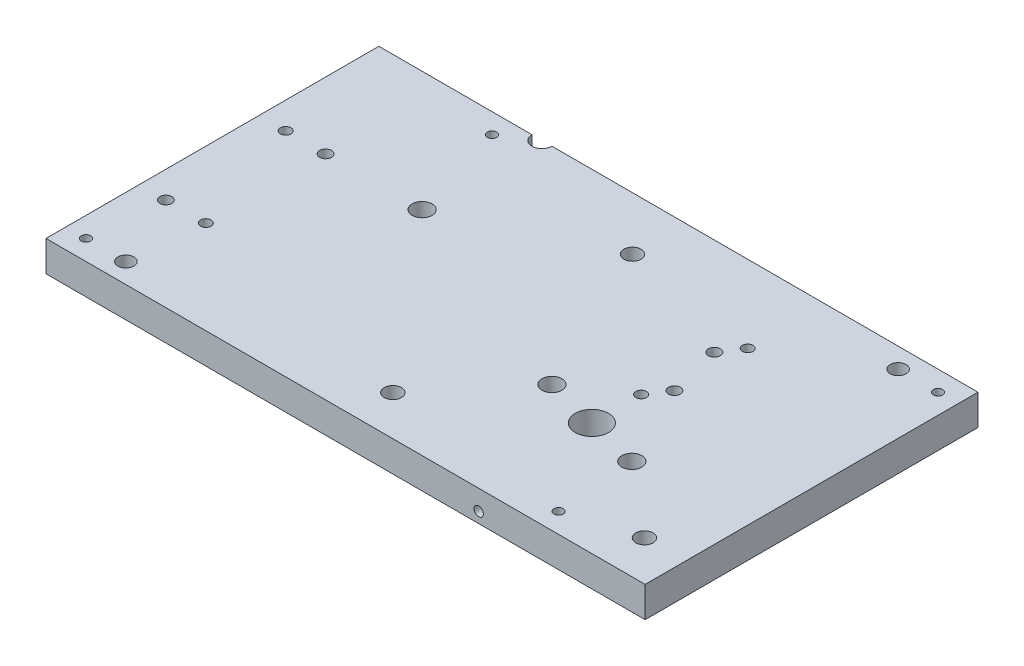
ISO-10303-21;
HEADER;
FILE_DESCRIPTION(('STEP AP214'),'2;1');
FILE_NAME('part.step','',(''),(''),'','','');
FILE_SCHEMA(('AUTOMOTIVE_DESIGN { 1 0 10303 214 1 1 1 1 }'));
ENDSEC;
DATA;
#1=APPLICATION_CONTEXT('core data for automotive mechanical design processes');
#2=APPLICATION_PROTOCOL_DEFINITION('international standard','automotive_design',2000,#1);
#3=PRODUCT_CONTEXT('',#1,'mechanical');
#4=PRODUCT('Part','Part','',(#3));
#5=PRODUCT_RELATED_PRODUCT_CATEGORY('part','',(#4));
#6=PRODUCT_DEFINITION_FORMATION('','',#4);
#7=PRODUCT_DEFINITION_CONTEXT('part definition',#1,'design');
#8=PRODUCT_DEFINITION('design','',#6,#7);
#9=PRODUCT_DEFINITION_SHAPE('','',#8);
#10=(LENGTH_UNIT() NAMED_UNIT(*) SI_UNIT(.MILLI.,.METRE.));
#11=(NAMED_UNIT(*) PLANE_ANGLE_UNIT() SI_UNIT($,.RADIAN.));
#12=(NAMED_UNIT(*) SI_UNIT($,.STERADIAN.) SOLID_ANGLE_UNIT());
#13=UNCERTAINTY_MEASURE_WITH_UNIT(LENGTH_MEASURE(1.E-05),#10,'distance_accuracy_value','');
#14=(GEOMETRIC_REPRESENTATION_CONTEXT(3) GLOBAL_UNCERTAINTY_ASSIGNED_CONTEXT((#13)) GLOBAL_UNIT_ASSIGNED_CONTEXT((#10,
#11,#12)) REPRESENTATION_CONTEXT('',''));
#15=CARTESIAN_POINT('',(0.,0.,0.));
#16=DIRECTION('',(0.,0.,1.));
#17=DIRECTION('',(1.,0.,0.));
#18=AXIS2_PLACEMENT_3D('',#15,#16,#17);
#19=CARTESIAN_POINT('',(-0.000732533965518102,-203.420000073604,283.999993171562));
#20=DIRECTION('',(0.,0.,1.));
#21=DIRECTION('',(1.,0.,0.));
#22=AXIS2_PLACEMENT_3D('',#19,#20,#21);
#23=CONICAL_SURFACE('',#22,3.49999999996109,1.0471975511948);
#24=CARTESIAN_POINT('',(-0.000732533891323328,-203.420000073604,281.979267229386));
#25=VERTEX_POINT('',#24);
#26=VERTEX_LOOP('',#25);
#27=FACE_BOUND('',#26,.T.);
#28=CARTESIAN_POINT('',(-0.000732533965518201,-203.420000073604,283.999993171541));
#29=DIRECTION('',(0.,0.,-1.));
#30=DIRECTION('',(1.,0.,0.));
#31=AXIS2_PLACEMENT_3D('',#28,#29,#30);
#32=CIRCLE('',#31,3.5);
#33=CARTESIAN_POINT('',(3.49926746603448,-203.420000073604,283.999993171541));
#34=VERTEX_POINT('',#33);
#35=EDGE_CURVE('E83',#34,#34,#32,.F.);
#36=ORIENTED_EDGE('',*,*,#35,.T.);
#37=EDGE_LOOP('',(#36));
#38=FACE_BOUND('',#37,.T.);
#39=ADVANCED_FACE('F15',(#27,#38),#23,.F.);
#40=CARTESIAN_POINT('',(-274.996513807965,-201.420000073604,143.999992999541));
#41=DIRECTION('',(0.,1.,0.));
#42=DIRECTION('',(0.,0.,1.));
#43=AXIS2_PLACEMENT_3D('',#40,#41,#42);
#44=CYLINDRICAL_SURFACE('',#43,4.5);
#45=CARTESIAN_POINT('',(-274.996513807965,-188.420000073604,143.999992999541));
#46=DIRECTION('',(0.,1.,0.));
#47=DIRECTION('',(0.,0.,1.));
#48=AXIS2_PLACEMENT_3D('',#45,#46,#47);
#49=CIRCLE('',#48,4.5);
#50=CARTESIAN_POINT('',(-274.996513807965,-188.420000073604,148.499992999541));
#51=VERTEX_POINT('',#50);
#52=EDGE_CURVE('E234',#51,#51,#49,.T.);
#53=ORIENTED_EDGE('',*,*,#52,.T.);
#54=EDGE_LOOP('',(#53));
#55=FACE_BOUND('',#54,.T.);
#56=CARTESIAN_POINT('',(-274.996513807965,-201.420000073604,143.999992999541));
#57=DIRECTION('',(0.,1.,0.));
#58=DIRECTION('',(0.,0.,1.));
#59=AXIS2_PLACEMENT_3D('',#56,#57,#58);
#60=CIRCLE('',#59,4.5);
#61=CARTESIAN_POINT('',(-274.996513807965,-201.420000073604,148.499992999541));
#62=VERTEX_POINT('',#61);
#63=EDGE_CURVE('E237',#62,#62,#60,.F.);
#64=ORIENTED_EDGE('',*,*,#63,.T.);
#65=EDGE_LOOP('',(#64));
#66=FACE_BOUND('',#65,.T.);
#67=ADVANCED_FACE('F79',(#55,#66),#44,.F.);
#68=CARTESIAN_POINT('',(-304.996513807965,-201.420000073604,233.999992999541));
#69=DIRECTION('',(0.,1.,0.));
#70=DIRECTION('',(0.,0.,1.));
#71=AXIS2_PLACEMENT_3D('',#68,#69,#70);
#72=CYLINDRICAL_SURFACE('',#71,4.5);
#73=CARTESIAN_POINT('',(-304.996513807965,-188.420000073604,233.999992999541));
#74=DIRECTION('',(0.,1.,0.));
#75=DIRECTION('',(0.,0.,1.));
#76=AXIS2_PLACEMENT_3D('',#73,#74,#75);
#77=CIRCLE('',#76,4.5);
#78=CARTESIAN_POINT('',(-304.996513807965,-188.420000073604,238.499992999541));
#79=VERTEX_POINT('',#78);
#80=EDGE_CURVE('E231',#79,#79,#77,.T.);
#81=ORIENTED_EDGE('',*,*,#80,.T.);
#82=EDGE_LOOP('',(#81));
#83=FACE_BOUND('',#82,.T.);
#84=CARTESIAN_POINT('',(-304.996513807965,-201.420000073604,233.999992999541));
#85=DIRECTION('',(0.,1.,0.));
#86=DIRECTION('',(0.,0.,1.));
#87=AXIS2_PLACEMENT_3D('',#84,#85,#86);
#88=CIRCLE('',#87,4.5);
#89=CARTESIAN_POINT('',(-304.996513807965,-201.420000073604,238.499992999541));
#90=VERTEX_POINT('',#89);
#91=EDGE_CURVE('E240',#90,#90,#88,.F.);
#92=ORIENTED_EDGE('',*,*,#91,.T.);
#93=EDGE_LOOP('',(#92));
#94=FACE_BOUND('',#93,.T.);
#95=ADVANCED_FACE('F460',(#83,#94),#72,.F.);
#96=CARTESIAN_POINT('',(9.99926746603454,-201.420000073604,166.999993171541));
#97=DIRECTION('',(0.,1.,0.));
#98=DIRECTION('',(0.,0.,1.));
#99=AXIS2_PLACEMENT_3D('',#96,#97,#98);
#100=CYLINDRICAL_SURFACE('',#99,4.5);
#101=CARTESIAN_POINT('',(9.99926746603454,-188.420000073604,166.999993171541));
#102=DIRECTION('',(0.,1.,0.));
#103=DIRECTION('',(0.,0.,1.));
#104=AXIS2_PLACEMENT_3D('',#101,#102,#103);
#105=CIRCLE('',#104,4.5);
#106=CARTESIAN_POINT('',(9.99926746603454,-188.420000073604,171.499993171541));
#107=VERTEX_POINT('',#106);
#108=EDGE_CURVE('E228',#107,#107,#105,.T.);
#109=ORIENTED_EDGE('',*,*,#108,.T.);
#110=EDGE_LOOP('',(#109));
#111=FACE_BOUND('',#110,.T.);
#112=CARTESIAN_POINT('',(9.99926746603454,-201.420000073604,166.999993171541));
#113=DIRECTION('',(0.,1.,0.));
#114=DIRECTION('',(0.,0.,1.));
#115=AXIS2_PLACEMENT_3D('',#112,#113,#114);
#116=CIRCLE('',#115,4.5);
#117=CARTESIAN_POINT('',(9.99926746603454,-201.420000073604,171.499993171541));
#118=VERTEX_POINT('',#117);
#119=EDGE_CURVE('E87',#118,#118,#116,.F.);
#120=ORIENTED_EDGE('',*,*,#119,.T.);
#121=EDGE_LOOP('',(#120));
#122=FACE_BOUND('',#121,.T.);
#123=ADVANCED_FACE('F245',(#111,#122),#100,.F.);
#124=CARTESIAN_POINT('',(-0.00073253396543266,-201.420000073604,126.999993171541));
#125=DIRECTION('',(0.,1.,0.));
#126=DIRECTION('',(0.,0.,1.));
#127=AXIS2_PLACEMENT_3D('',#124,#125,#126);
#128=CYLINDRICAL_SURFACE('',#127,4.5);
#129=CARTESIAN_POINT('',(-0.00073253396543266,-188.420000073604,126.999993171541));
#130=DIRECTION('',(0.,1.,0.));
#131=DIRECTION('',(0.,0.,1.));
#132=AXIS2_PLACEMENT_3D('',#129,#130,#131);
#133=CIRCLE('',#132,4.5);
#134=CARTESIAN_POINT('',(-0.00073253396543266,-188.420000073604,131.499993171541));
#135=VERTEX_POINT('',#134);
#136=EDGE_CURVE('E225',#135,#135,#133,.T.);
#137=ORIENTED_EDGE('',*,*,#136,.T.);
#138=EDGE_LOOP('',(#137));
#139=FACE_BOUND('',#138,.T.);
#140=CARTESIAN_POINT('',(-0.00073253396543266,-201.420000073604,126.999993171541));
#141=DIRECTION('',(0.,1.,0.));
#142=DIRECTION('',(0.,0.,1.));
#143=AXIS2_PLACEMENT_3D('',#140,#141,#142);
#144=CIRCLE('',#143,4.5);
#145=CARTESIAN_POINT('',(-0.00073253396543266,-201.420000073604,131.499993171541));
#146=VERTEX_POINT('',#145);
#147=EDGE_CURVE('E19',#146,#146,#144,.F.);
#148=ORIENTED_EDGE('',*,*,#147,.T.);
#149=EDGE_LOOP('',(#148));
#150=FACE_BOUND('',#149,.T.);
#151=ADVANCED_FACE('F445',(#139,#150),#128,.F.);
#152=CARTESIAN_POINT('',(-0.000732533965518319,-203.420000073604,303.999993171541));
#153=DIRECTION('',(0.,0.,-1.));
#154=DIRECTION('',(-1.,0.,0.));
#155=AXIS2_PLACEMENT_3D('',#152,#153,#154);
#156=CYLINDRICAL_SURFACE('',#155,3.5);
#157=CARTESIAN_POINT('',(-0.000732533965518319,-203.420000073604,303.999993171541));
#158=DIRECTION('',(0.,0.,-1.));
#159=DIRECTION('',(-1.,0.,0.));
#160=AXIS2_PLACEMENT_3D('',#157,#158,#159);
#161=CIRCLE('',#160,3.5);
#162=CARTESIAN_POINT('',(-3.50073253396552,-203.420000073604,303.999993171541));
#163=VERTEX_POINT('',#162);
#164=EDGE_CURVE('E220',#163,#163,#161,.T.);
#165=ORIENTED_EDGE('',*,*,#164,.F.);
#166=EDGE_LOOP('',(#165));
#167=FACE_BOUND('',#166,.T.);
#168=ORIENTED_EDGE('',*,*,#35,.F.);
#169=EDGE_LOOP('',(#168));
#170=FACE_BOUND('',#169,.T.);
#171=ADVANCED_FACE('F444',(#167,#170),#156,.F.);
#172=CARTESIAN_POINT('',(-0.000732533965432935,-201.420000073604,126.999993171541));
#173=DIRECTION('',(0.,1.,0.));
#174=DIRECTION('',(0.,0.,1.));
#175=AXIS2_PLACEMENT_3D('',#172,#173,#174);
#176=PLANE('',#175);
#177=ORIENTED_EDGE('',*,*,#147,.F.);
#178=EDGE_LOOP('',(#177));
#179=FACE_BOUND('',#178,.T.);
#180=CARTESIAN_POINT('',(-0.000732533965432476,-201.420000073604,126.999993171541));
#181=DIRECTION('',(0.,1.,0.));
#182=DIRECTION('',(0.,0.,1.));
#183=AXIS2_PLACEMENT_3D('',#180,#181,#182);
#184=CIRCLE('',#183,7.50000000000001);
#185=CARTESIAN_POINT('',(-0.000732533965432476,-201.420000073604,134.499993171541));
#186=VERTEX_POINT('',#185);
#187=EDGE_CURVE('E176',#186,#186,#184,.F.);
#188=ORIENTED_EDGE('',*,*,#187,.T.);
#189=EDGE_LOOP('',(#188));
#190=FACE_BOUND('',#189,.T.);
#191=ADVANCED_FACE('F250',(#179,#190),#176,.F.);
#192=CARTESIAN_POINT('',(9.99926746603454,-201.420000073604,166.999993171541));
#193=DIRECTION('',(0.,1.,0.));
#194=DIRECTION('',(0.,0.,1.));
#195=AXIS2_PLACEMENT_3D('',#192,#193,#194);
#196=PLANE('',#195);
#197=ORIENTED_EDGE('',*,*,#119,.F.);
#198=EDGE_LOOP('',(#197));
#199=FACE_BOUND('',#198,.T.);
#200=CARTESIAN_POINT('',(9.99926746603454,-201.420000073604,166.999993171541));
#201=DIRECTION('',(0.,1.,0.));
#202=DIRECTION('',(0.,0.,1.));
#203=AXIS2_PLACEMENT_3D('',#200,#201,#202);
#204=CIRCLE('',#203,7.50000000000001);
#205=CARTESIAN_POINT('',(9.99926746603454,-201.420000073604,174.499993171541));
#206=VERTEX_POINT('',#205);
#207=EDGE_CURVE('E173',#206,#206,#204,.F.);
#208=ORIENTED_EDGE('',*,*,#207,.T.);
#209=EDGE_LOOP('',(#208));
#210=FACE_BOUND('',#209,.T.);
#211=ADVANCED_FACE('F247',(#199,#210),#196,.F.);
#212=CARTESIAN_POINT('',(-304.996513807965,-201.420000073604,233.999992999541));
#213=DIRECTION('',(0.,1.,0.));
#214=DIRECTION('',(0.,0.,1.));
#215=AXIS2_PLACEMENT_3D('',#212,#213,#214);
#216=PLANE('',#215);
#217=ORIENTED_EDGE('',*,*,#91,.F.);
#218=EDGE_LOOP('',(#217));
#219=FACE_BOUND('',#218,.T.);
#220=CARTESIAN_POINT('',(-304.996513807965,-201.420000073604,233.999992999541));
#221=DIRECTION('',(0.,1.,0.));
#222=DIRECTION('',(0.,0.,1.));
#223=AXIS2_PLACEMENT_3D('',#220,#221,#222);
#224=CIRCLE('',#223,7.50000000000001);
#225=CARTESIAN_POINT('',(-304.996513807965,-201.420000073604,241.499992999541));
#226=VERTEX_POINT('',#225);
#227=EDGE_CURVE('E170',#226,#226,#224,.F.);
#228=ORIENTED_EDGE('',*,*,#227,.T.);
#229=EDGE_LOOP('',(#228));
#230=FACE_BOUND('',#229,.T.);
#231=ADVANCED_FACE('F249',(#219,#230),#216,.F.);
#232=CARTESIAN_POINT('',(-274.996513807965,-201.420000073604,143.999992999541));
#233=DIRECTION('',(0.,1.,0.));
#234=DIRECTION('',(0.,0.,1.));
#235=AXIS2_PLACEMENT_3D('',#232,#233,#234);
#236=PLANE('',#235);
#237=ORIENTED_EDGE('',*,*,#63,.F.);
#238=EDGE_LOOP('',(#237));
#239=FACE_BOUND('',#238,.T.);
#240=CARTESIAN_POINT('',(-274.996513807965,-201.420000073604,143.999992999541));
#241=DIRECTION('',(0.,1.,0.));
#242=DIRECTION('',(0.,0.,1.));
#243=AXIS2_PLACEMENT_3D('',#240,#241,#242);
#244=CIRCLE('',#243,7.50000000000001);
#245=CARTESIAN_POINT('',(-274.996513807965,-201.420000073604,151.499992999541));
#246=VERTEX_POINT('',#245);
#247=EDGE_CURVE('E167',#246,#246,#244,.F.);
#248=ORIENTED_EDGE('',*,*,#247,.T.);
#249=EDGE_LOOP('',(#248));
#250=FACE_BOUND('',#249,.T.);
#251=ADVANCED_FACE('F426',(#239,#250),#236,.F.);
#252=CARTESIAN_POINT('',(-100.000732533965,-188.420000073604,178.999993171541));
#253=DIRECTION('',(0.,-1.,0.));
#254=DIRECTION('',(0.,0.,-1.));
#255=AXIS2_PLACEMENT_3D('',#252,#253,#254);
#256=PLANE('',#255);
#257=CARTESIAN_POINT('',(-202.501514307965,-188.420000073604,143.999992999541));
#258=DIRECTION('',(0.,-1.,0.));
#259=DIRECTION('',(0.,0.,-1.));
#260=AXIS2_PLACEMENT_3D('',#257,#258,#259);
#261=CIRCLE('',#260,7.50000000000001);
#262=CARTESIAN_POINT('',(-202.501514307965,-188.420000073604,136.499992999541));
#263=VERTEX_POINT('',#262);
#264=EDGE_CURVE('E215',#263,#263,#261,.T.);
#265=ORIENTED_EDGE('',*,*,#264,.T.);
#266=EDGE_LOOP('',(#265));
#267=FACE_BOUND('',#266,.T.);
#268=CARTESIAN_POINT('',(-225.000732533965,-188.420000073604,68.9999931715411));
#269=DIRECTION('',(0.,-1.,0.));
#270=DIRECTION('',(0.,0.,-1.));
#271=AXIS2_PLACEMENT_3D('',#268,#269,#270);
#272=CIRCLE('',#271,3.5);
#273=CARTESIAN_POINT('',(-225.000732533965,-188.420000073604,65.4999931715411));
#274=VERTEX_POINT('',#273);
#275=EDGE_CURVE('E212',#274,#274,#272,.T.);
#276=ORIENTED_EDGE('',*,*,#275,.T.);
#277=EDGE_LOOP('',(#276));
#278=FACE_BOUND('',#277,.T.);
#279=CARTESIAN_POINT('',(79.9992674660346,-188.420000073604,68.999993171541));
#280=DIRECTION('',(0.,-1.,0.));
#281=DIRECTION('',(0.,0.,-1.));
#282=AXIS2_PLACEMENT_3D('',#279,#280,#281);
#283=CIRCLE('',#282,6.00000000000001);
#284=CARTESIAN_POINT('',(79.9992674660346,-188.420000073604,62.999993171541));
#285=VERTEX_POINT('',#284);
#286=EDGE_CURVE('E209',#285,#285,#283,.T.);
#287=ORIENTED_EDGE('',*,*,#286,.T.);
#288=EDGE_LOOP('',(#287));
#289=FACE_BOUND('',#288,.T.);
#290=CARTESIAN_POINT('',(109.999267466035,-188.420000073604,68.999993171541));
#291=DIRECTION('',(0.,-1.,0.));
#292=DIRECTION('',(0.,0.,-1.));
#293=AXIS2_PLACEMENT_3D('',#290,#291,#292);
#294=CIRCLE('',#293,3.5);
#295=CARTESIAN_POINT('',(109.999267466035,-188.420000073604,65.4999931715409));
#296=VERTEX_POINT('',#295);
#297=EDGE_CURVE('E206',#296,#296,#294,.T.);
#298=ORIENTED_EDGE('',*,*,#297,.T.);
#299=EDGE_LOOP('',(#298));
#300=FACE_BOUND('',#299,.T.);
#301=CARTESIAN_POINT('',(44.9992674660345,-188.420000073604,288.999993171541));
#302=DIRECTION('',(0.,-1.,0.));
#303=DIRECTION('',(0.,0.,-1.));
#304=AXIS2_PLACEMENT_3D('',#301,#302,#303);
#305=CIRCLE('',#304,3.5);
#306=CARTESIAN_POINT('',(44.9992674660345,-188.420000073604,285.499993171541));
#307=VERTEX_POINT('',#306);
#308=EDGE_CURVE('E203',#307,#307,#305,.T.);
#309=ORIENTED_EDGE('',*,*,#308,.T.);
#310=EDGE_LOOP('',(#309));
#311=FACE_BOUND('',#310,.T.);
#312=CARTESIAN_POINT('',(-280.000732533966,-188.420000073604,288.999993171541));
#313=DIRECTION('',(0.,-1.,0.));
#314=DIRECTION('',(0.,0.,-1.));
#315=AXIS2_PLACEMENT_3D('',#312,#313,#314);
#316=CIRCLE('',#315,6.00000000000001);
#317=CARTESIAN_POINT('',(-280.000732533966,-188.420000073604,282.999993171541));
#318=VERTEX_POINT('',#317);
#319=EDGE_CURVE('E200',#318,#318,#316,.T.);
#320=ORIENTED_EDGE('',*,*,#319,.T.);
#321=EDGE_LOOP('',(#320));
#322=FACE_BOUND('',#321,.T.);
#323=CARTESIAN_POINT('',(-310.000732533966,-188.420000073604,288.999993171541));
#324=DIRECTION('',(0.,-1.,0.));
#325=DIRECTION('',(0.,0.,-1.));
#326=AXIS2_PLACEMENT_3D('',#323,#324,#325);
#327=CIRCLE('',#326,3.5);
#328=CARTESIAN_POINT('',(-310.000732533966,-188.420000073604,285.499993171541));
#329=VERTEX_POINT('',#328);
#330=EDGE_CURVE('E197',#329,#329,#327,.T.);
#331=ORIENTED_EDGE('',*,*,#330,.T.);
#332=EDGE_LOOP('',(#331));
#333=FACE_BOUND('',#332,.T.);
#334=CARTESIAN_POINT('',(94.5000000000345,-188.420000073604,273.999999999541));
#335=DIRECTION('',(0.,-1.,0.));
#336=DIRECTION('',(0.,0.,-1.));
#337=AXIS2_PLACEMENT_3D('',#334,#335,#336);
#338=CIRCLE('',#337,6.50000000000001);
#339=CARTESIAN_POINT('',(94.5000000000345,-188.420000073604,267.499999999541));
#340=VERTEX_POINT('',#339);
#341=EDGE_CURVE('E194',#340,#340,#338,.T.);
#342=ORIENTED_EDGE('',*,*,#341,.T.);
#343=EDGE_LOOP('',(#342));
#344=FACE_BOUND('',#343,.T.);
#345=CARTESIAN_POINT('',(-94.4999999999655,-188.420000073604,273.999999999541));
#346=DIRECTION('',(0.,-1.,0.));
#347=DIRECTION('',(0.,0.,-1.));
#348=AXIS2_PLACEMENT_3D('',#345,#346,#347);
#349=CIRCLE('',#348,6.50000000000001);
#350=CARTESIAN_POINT('',(-94.4999999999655,-188.420000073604,267.499999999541));
#351=VERTEX_POINT('',#350);
#352=EDGE_CURVE('E191',#351,#351,#349,.T.);
#353=ORIENTED_EDGE('',*,*,#352,.T.);
#354=EDGE_LOOP('',(#353));
#355=FACE_BOUND('',#354,.T.);
#356=CARTESIAN_POINT('',(-94.4999999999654,-188.420000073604,93.999999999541));
#357=DIRECTION('',(0.,-1.,0.));
#358=DIRECTION('',(0.,0.,-1.));
#359=AXIS2_PLACEMENT_3D('',#356,#357,#358);
#360=CIRCLE('',#359,6.50000000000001);
#361=CARTESIAN_POINT('',(-94.4999999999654,-188.420000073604,87.499999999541));
#362=VERTEX_POINT('',#361);
#363=EDGE_CURVE('E188',#362,#362,#360,.T.);
#364=ORIENTED_EDGE('',*,*,#363,.T.);
#365=EDGE_LOOP('',(#364));
#366=FACE_BOUND('',#365,.T.);
#367=CARTESIAN_POINT('',(39.9992674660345,-188.420000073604,228.999993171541));
#368=DIRECTION('',(0.,-1.,0.));
#369=DIRECTION('',(0.,0.,-1.));
#370=AXIS2_PLACEMENT_3D('',#367,#368,#369);
#371=CIRCLE('',#370,7.50000000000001);
#372=CARTESIAN_POINT('',(39.9992674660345,-188.420000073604,221.499993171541));
#373=VERTEX_POINT('',#372);
#374=EDGE_CURVE('E185',#373,#373,#371,.T.);
#375=ORIENTED_EDGE('',*,*,#374,.T.);
#376=EDGE_LOOP('',(#375));
#377=FACE_BOUND('',#376,.T.);
#378=CARTESIAN_POINT('',(-40.0007325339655,-188.420000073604,208.999993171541));
#379=DIRECTION('',(0.,-1.,0.));
#380=DIRECTION('',(0.,0.,-1.));
#381=AXIS2_PLACEMENT_3D('',#378,#379,#380);
#382=CIRCLE('',#381,7.50000000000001);
#383=CARTESIAN_POINT('',(-40.0007325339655,-188.420000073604,201.499993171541));
#384=VERTEX_POINT('',#383);
#385=EDGE_CURVE('E182',#384,#384,#382,.T.);
#386=ORIENTED_EDGE('',*,*,#385,.T.);
#387=EDGE_LOOP('',(#386));
#388=FACE_BOUND('',#387,.T.);
#389=CARTESIAN_POINT('',(-0.000732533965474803,-188.420000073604,218.999993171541));
#390=DIRECTION('',(0.,-1.,0.));
#391=DIRECTION('',(0.,0.,-1.));
#392=AXIS2_PLACEMENT_3D('',#389,#390,#391);
#393=CIRCLE('',#392,12.5);
#394=CARTESIAN_POINT('',(-0.000732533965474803,-188.420000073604,206.499993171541));
#395=VERTEX_POINT('',#394);
#396=EDGE_CURVE('E179',#395,#395,#393,.T.);
#397=ORIENTED_EDGE('',*,*,#396,.T.);
#398=EDGE_LOOP('',(#397));
#399=FACE_BOUND('',#398,.T.);
#400=ORIENTED_EDGE('',*,*,#136,.F.);
#401=EDGE_LOOP('',(#400));
#402=FACE_BOUND('',#401,.T.);
#403=ORIENTED_EDGE('',*,*,#108,.F.);
#404=EDGE_LOOP('',(#403));
#405=FACE_BOUND('',#404,.T.);
#406=ORIENTED_EDGE('',*,*,#80,.F.);
#407=EDGE_LOOP('',(#406));
#408=FACE_BOUND('',#407,.T.);
#409=ORIENTED_EDGE('',*,*,#52,.F.);
#410=EDGE_LOOP('',(#409));
#411=FACE_BOUND('',#410,.T.);
#412=CARTESIAN_POINT('',(-0.000732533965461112,-188.420000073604,181.999993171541));
#413=DIRECTION('',(0.,-1.,0.));
#414=DIRECTION('',(0.,0.,-1.));
#415=AXIS2_PLACEMENT_3D('',#412,#413,#414);
#416=CIRCLE('',#415,4.);
#417=CARTESIAN_POINT('',(-0.000732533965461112,-188.420000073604,177.999993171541));
#418=VERTEX_POINT('',#417);
#419=EDGE_CURVE('E164',#418,#418,#416,.T.);
#420=ORIENTED_EDGE('',*,*,#419,.T.);
#421=EDGE_LOOP('',(#420));
#422=FACE_BOUND('',#421,.T.);
#423=CARTESIAN_POINT('',(9.99926746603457,-188.420000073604,111.999993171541));
#424=DIRECTION('',(0.,-1.,0.));
#425=DIRECTION('',(0.,0.,-1.));
#426=AXIS2_PLACEMENT_3D('',#423,#424,#425);
#427=CIRCLE('',#426,4.);
#428=CARTESIAN_POINT('',(9.99926746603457,-188.420000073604,107.999993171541));
#429=VERTEX_POINT('',#428);
#430=EDGE_CURVE('E161',#429,#429,#427,.T.);
#431=ORIENTED_EDGE('',*,*,#430,.T.);
#432=EDGE_LOOP('',(#431));
#433=FACE_BOUND('',#432,.T.);
#434=CARTESIAN_POINT('',(-304.996513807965,-188.420000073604,143.999992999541));
#435=DIRECTION('',(0.,-1.,0.));
#436=DIRECTION('',(0.,0.,-1.));
#437=AXIS2_PLACEMENT_3D('',#434,#435,#436);
#438=CIRCLE('',#437,4.);
#439=CARTESIAN_POINT('',(-304.996513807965,-188.420000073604,139.999992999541));
#440=VERTEX_POINT('',#439);
#441=EDGE_CURVE('E158',#440,#440,#438,.T.);
#442=ORIENTED_EDGE('',*,*,#441,.T.);
#443=EDGE_LOOP('',(#442));
#444=FACE_BOUND('',#443,.T.);
#445=CARTESIAN_POINT('',(-274.996513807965,-188.420000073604,233.999992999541));
#446=DIRECTION('',(0.,-1.,0.));
#447=DIRECTION('',(0.,0.,-1.));
#448=AXIS2_PLACEMENT_3D('',#445,#446,#447);
#449=CIRCLE('',#448,4.);
#450=CARTESIAN_POINT('',(-274.996513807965,-188.420000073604,229.999992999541));
#451=VERTEX_POINT('',#450);
#452=EDGE_CURVE('E154',#451,#451,#449,.T.);
#453=ORIENTED_EDGE('',*,*,#452,.T.);
#454=EDGE_LOOP('',(#453));
#455=FACE_BOUND('',#454,.T.);
#456=CARTESIAN_POINT('',(-202.501514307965,-188.420000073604,53.999992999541));
#457=DIRECTION('',(0.,-1.,0.));
#458=DIRECTION('',(0.,0.,-1.));
#459=AXIS2_PLACEMENT_3D('',#456,#457,#458);
#460=CIRCLE('',#459,7.5);
#461=CARTESIAN_POINT('',(-195.001514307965,-188.420000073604,53.9999931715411));
#462=VERTEX_POINT('',#461);
#463=CARTESIAN_POINT('',(-210.001514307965,-188.420000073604,53.9999931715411));
#464=VERTEX_POINT('',#463);
#465=EDGE_CURVE('E53',#462,#464,#460,.T.);
#466=ORIENTED_EDGE('',*,*,#465,.T.);
#467=DIRECTION('',(-1.,0.,0.));
#468=VECTOR('',#467,1.);
#469=CARTESIAN_POINT('',(124.999267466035,-188.420000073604,53.999993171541));
#470=LINE('',#469,#468);
#471=CARTESIAN_POINT('',(-325.000732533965,-188.420000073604,53.9999931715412));
#472=VERTEX_POINT('',#471);
#473=EDGE_CURVE('E48',#472,#464,#470,.F.);
#474=ORIENTED_EDGE('',*,*,#473,.F.);
#475=DIRECTION('',(0.,0.,1.));
#476=VECTOR('',#475,1.);
#477=CARTESIAN_POINT('',(-325.000732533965,-188.420000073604,53.9999931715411));
#478=LINE('',#477,#476);
#479=CARTESIAN_POINT('',(-325.000732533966,-188.420000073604,303.999993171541));
#480=VERTEX_POINT('',#479);
#481=EDGE_CURVE('E339',#480,#472,#478,.F.);
#482=ORIENTED_EDGE('',*,*,#481,.F.);
#483=DIRECTION('',(1.,0.,0.));
#484=VECTOR('',#483,1.);
#485=CARTESIAN_POINT('',(-325.000732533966,-188.420000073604,303.999993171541));
#486=LINE('',#485,#484);
#487=CARTESIAN_POINT('',(124.999267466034,-188.420000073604,303.999993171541));
#488=VERTEX_POINT('',#487);
#489=EDGE_CURVE('E223',#488,#480,#486,.F.);
#490=ORIENTED_EDGE('',*,*,#489,.F.);
#491=DIRECTION('',(0.,0.,1.));
#492=VECTOR('',#491,1.);
#493=CARTESIAN_POINT('',(124.999267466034,-188.420000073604,303.999993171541));
#494=LINE('',#493,#492);
#495=CARTESIAN_POINT('',(124.999267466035,-188.420000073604,53.999993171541));
#496=VERTEX_POINT('',#495);
#497=EDGE_CURVE('E323',#496,#488,#494,.T.);
#498=ORIENTED_EDGE('',*,*,#497,.F.);
#499=DIRECTION('',(-1.,0.,0.));
#500=VECTOR('',#499,1.);
#501=CARTESIAN_POINT('',(124.999267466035,-188.420000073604,53.999993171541));
#502=LINE('',#501,#500);
#503=EDGE_CURVE('E59',#462,#496,#502,.F.);
#504=ORIENTED_EDGE('',*,*,#503,.F.);
#505=EDGE_LOOP('',(#466,#474,#482,#490,#498,#504));
#506=FACE_BOUND('',#505,.T.);
#507=ADVANCED_FACE('F359',(#267,#278,#289,#300,#311,#322,#333,#344,#355,#366,#377,#388,#399,
#402,#405,#408,#411,#422,#433,#444,#455,#506),#256,.F.);
#508=CARTESIAN_POINT('',(124.999267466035,-188.420000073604,53.999993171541));
#509=DIRECTION('',(0.,0.,-1.));
#510=DIRECTION('',(-1.,0.,0.));
#511=AXIS2_PLACEMENT_3D('',#508,#509,#510);
#512=PLANE('',#511);
#513=DIRECTION('',(0.,1.,0.));
#514=VECTOR('',#513,1.);
#515=CARTESIAN_POINT('',(-325.000732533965,-188.420000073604,53.9999931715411));
#516=LINE('',#515,#514);
#517=CARTESIAN_POINT('',(-325.000732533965,-211.420000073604,53.9999931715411));
#518=VERTEX_POINT('',#517);
#519=EDGE_CURVE('E224',#472,#518,#516,.F.);
#520=ORIENTED_EDGE('',*,*,#519,.F.);
#521=ORIENTED_EDGE('',*,*,#473,.T.);
#522=DIRECTION('',(0.,-1.,0.));
#523=VECTOR('',#522,1.);
#524=CARTESIAN_POINT('',(-210.001514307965,-703.715061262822,53.9999931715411));
#525=LINE('',#524,#523);
#526=CARTESIAN_POINT('',(-210.001514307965,-211.420000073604,53.9999931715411));
#527=VERTEX_POINT('',#526);
#528=EDGE_CURVE('E218',#464,#527,#525,.T.);
#529=ORIENTED_EDGE('',*,*,#528,.T.);
#530=DIRECTION('',(1.,0.,0.));
#531=VECTOR('',#530,1.);
#532=CARTESIAN_POINT('',(124.999267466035,-211.420000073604,53.9999931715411));
#533=LINE('',#532,#531);
#534=EDGE_CURVE('E157',#527,#518,#533,.F.);
#535=ORIENTED_EDGE('',*,*,#534,.T.);
#536=EDGE_LOOP('',(#520,#521,#529,#535));
#537=FACE_BOUND('',#536,.T.);
#538=ADVANCED_FACE('F360',(#537),#512,.T.);
#539=CARTESIAN_POINT('',(-325.000732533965,-188.420000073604,53.9999931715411));
#540=DIRECTION('',(-1.,0.,0.));
#541=DIRECTION('',(0.,0.,1.));
#542=AXIS2_PLACEMENT_3D('',#539,#540,#541);
#543=PLANE('',#542);
#544=ORIENTED_EDGE('',*,*,#481,.T.);
#545=ORIENTED_EDGE('',*,*,#519,.T.);
#546=DIRECTION('',(0.,0.,1.));
#547=VECTOR('',#546,1.);
#548=CARTESIAN_POINT('',(-325.000732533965,-211.420000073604,53.999993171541));
#549=LINE('',#548,#547);
#550=CARTESIAN_POINT('',(-325.000732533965,-211.420000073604,303.999993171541));
#551=VERTEX_POINT('',#550);
#552=EDGE_CURVE('E310',#518,#551,#549,.T.);
#553=ORIENTED_EDGE('',*,*,#552,.T.);
#554=DIRECTION('',(0.,-1.,0.));
#555=VECTOR('',#554,1.);
#556=CARTESIAN_POINT('',(-325.000732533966,-188.420000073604,303.999993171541));
#557=LINE('',#556,#555);
#558=EDGE_CURVE('E330',#480,#551,#557,.T.);
#559=ORIENTED_EDGE('',*,*,#558,.F.);
#560=EDGE_LOOP('',(#544,#545,#553,#559));
#561=FACE_BOUND('',#560,.T.);
#562=ADVANCED_FACE('F356',(#561),#543,.T.);
#563=CARTESIAN_POINT('',(-325.000732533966,-188.420000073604,303.999993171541));
#564=DIRECTION('',(0.,0.,1.));
#565=DIRECTION('',(0.,-1.,0.));
#566=AXIS2_PLACEMENT_3D('',#563,#564,#565);
#567=PLANE('',#566);
#568=ORIENTED_EDGE('',*,*,#489,.T.);
#569=ORIENTED_EDGE('',*,*,#558,.T.);
#570=DIRECTION('',(1.,0.,0.));
#571=VECTOR('',#570,1.);
#572=CARTESIAN_POINT('',(124.999267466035,-211.420000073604,303.999993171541));
#573=LINE('',#572,#571);
#574=CARTESIAN_POINT('',(124.999267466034,-211.420000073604,303.999993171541));
#575=VERTEX_POINT('',#574);
#576=EDGE_CURVE('E304',#551,#575,#573,.T.);
#577=ORIENTED_EDGE('',*,*,#576,.T.);
#578=DIRECTION('',(0.,1.,0.));
#579=VECTOR('',#578,1.);
#580=CARTESIAN_POINT('',(124.999267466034,-188.420000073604,303.999993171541));
#581=LINE('',#580,#579);
#582=EDGE_CURVE('E320',#488,#575,#581,.F.);
#583=ORIENTED_EDGE('',*,*,#582,.F.);
#584=EDGE_LOOP('',(#568,#569,#577,#583));
#585=FACE_BOUND('',#584,.T.);
#586=ORIENTED_EDGE('',*,*,#164,.T.);
#587=EDGE_LOOP('',(#586));
#588=FACE_BOUND('',#587,.T.);
#589=ADVANCED_FACE('F436',(#585,#588),#567,.T.);
#590=CARTESIAN_POINT('',(124.999267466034,-188.420000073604,303.999993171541));
#591=DIRECTION('',(1.,0.,0.));
#592=DIRECTION('',(0.,1.,0.));
#593=AXIS2_PLACEMENT_3D('',#590,#591,#592);
#594=PLANE('',#593);
#595=ORIENTED_EDGE('',*,*,#497,.T.);
#596=ORIENTED_EDGE('',*,*,#582,.T.);
#597=DIRECTION('',(0.,0.,1.));
#598=VECTOR('',#597,1.);
#599=CARTESIAN_POINT('',(124.999267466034,-211.420000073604,53.999993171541));
#600=LINE('',#599,#598);
#601=CARTESIAN_POINT('',(124.999267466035,-211.420000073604,53.999993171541));
#602=VERTEX_POINT('',#601);
#603=EDGE_CURVE('E302',#575,#602,#600,.F.);
#604=ORIENTED_EDGE('',*,*,#603,.T.);
#605=DIRECTION('',(0.,1.,0.));
#606=VECTOR('',#605,1.);
#607=CARTESIAN_POINT('',(124.999267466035,-188.420000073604,53.999993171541));
#608=LINE('',#607,#606);
#609=EDGE_CURVE('E301',#496,#602,#608,.F.);
#610=ORIENTED_EDGE('',*,*,#609,.F.);
#611=EDGE_LOOP('',(#595,#596,#604,#610));
#612=FACE_BOUND('',#611,.T.);
#613=ADVANCED_FACE('F367',(#612),#594,.T.);
#614=CARTESIAN_POINT('',(124.999267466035,-188.420000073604,53.999993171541));
#615=DIRECTION('',(0.,0.,-1.));
#616=DIRECTION('',(-1.,0.,0.));
#617=AXIS2_PLACEMENT_3D('',#614,#615,#616);
#618=PLANE('',#617);
#619=ORIENTED_EDGE('',*,*,#609,.T.);
#620=DIRECTION('',(1.,0.,0.));
#621=VECTOR('',#620,1.);
#622=CARTESIAN_POINT('',(124.999267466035,-211.420000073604,53.999993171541));
#623=LINE('',#622,#621);
#624=CARTESIAN_POINT('',(-195.001514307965,-211.420000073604,53.999993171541));
#625=VERTEX_POINT('',#624);
#626=EDGE_CURVE('E153',#602,#625,#623,.F.);
#627=ORIENTED_EDGE('',*,*,#626,.T.);
#628=DIRECTION('',(0.,-1.,0.));
#629=VECTOR('',#628,1.);
#630=CARTESIAN_POINT('',(-195.001514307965,-703.715061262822,53.9999931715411));
#631=LINE('',#630,#629);
#632=EDGE_CURVE('E34',#625,#462,#631,.F.);
#633=ORIENTED_EDGE('',*,*,#632,.T.);
#634=ORIENTED_EDGE('',*,*,#503,.T.);
#635=EDGE_LOOP('',(#619,#627,#633,#634));
#636=FACE_BOUND('',#635,.T.);
#637=ADVANCED_FACE('F299',(#636),#618,.T.);
#638=CARTESIAN_POINT('',(-202.501514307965,-188.420000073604,53.999992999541));
#639=DIRECTION('',(0.,-1.,0.));
#640=DIRECTION('',(0.,0.,-1.));
#641=AXIS2_PLACEMENT_3D('',#638,#639,#640);
#642=CYLINDRICAL_SURFACE('',#641,7.5);
#643=CARTESIAN_POINT('',(-202.501514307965,-211.420000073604,53.999992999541));
#644=DIRECTION('',(0.,-1.,0.));
#645=DIRECTION('',(0.,0.,-1.));
#646=AXIS2_PLACEMENT_3D('',#643,#644,#645);
#647=CIRCLE('',#646,7.5);
#648=EDGE_CURVE('E151',#625,#527,#647,.T.);
#649=ORIENTED_EDGE('',*,*,#648,.T.);
#650=ORIENTED_EDGE('',*,*,#528,.F.);
#651=ORIENTED_EDGE('',*,*,#465,.F.);
#652=ORIENTED_EDGE('',*,*,#632,.F.);
#653=EDGE_LOOP('',(#649,#650,#651,#652));
#654=FACE_BOUND('',#653,.T.);
#655=ADVANCED_FACE('F361',(#654),#642,.F.);
#656=CARTESIAN_POINT('',(-202.501514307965,-188.420000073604,143.999992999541));
#657=DIRECTION('',(0.,-1.,0.));
#658=DIRECTION('',(0.,0.,-1.));
#659=AXIS2_PLACEMENT_3D('',#656,#657,#658);
#660=CYLINDRICAL_SURFACE('',#659,7.50000000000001);
#661=CARTESIAN_POINT('',(-202.501514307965,-211.420000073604,143.999992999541));
#662=DIRECTION('',(0.,-1.,0.));
#663=DIRECTION('',(0.,0.,-1.));
#664=AXIS2_PLACEMENT_3D('',#661,#662,#663);
#665=CIRCLE('',#664,7.50000000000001);
#666=CARTESIAN_POINT('',(-202.501514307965,-211.420000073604,136.499992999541));
#667=VERTEX_POINT('',#666);
#668=EDGE_CURVE('E148',#667,#667,#665,.T.);
#669=ORIENTED_EDGE('',*,*,#668,.T.);
#670=EDGE_LOOP('',(#669));
#671=FACE_BOUND('',#670,.T.);
#672=ORIENTED_EDGE('',*,*,#264,.F.);
#673=EDGE_LOOP('',(#672));
#674=FACE_BOUND('',#673,.T.);
#675=ADVANCED_FACE('F362',(#671,#674),#660,.F.);
#676=CARTESIAN_POINT('',(-225.000732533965,-188.420000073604,68.9999931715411));
#677=DIRECTION('',(0.,-1.,0.));
#678=DIRECTION('',(0.,0.,-1.));
#679=AXIS2_PLACEMENT_3D('',#676,#677,#678);
#680=CYLINDRICAL_SURFACE('',#679,3.5);
#681=CARTESIAN_POINT('',(-225.000732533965,-211.420000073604,68.9999931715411));
#682=DIRECTION('',(0.,-1.,0.));
#683=DIRECTION('',(0.,0.,-1.));
#684=AXIS2_PLACEMENT_3D('',#681,#682,#683);
#685=CIRCLE('',#684,3.5);
#686=CARTESIAN_POINT('',(-225.000732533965,-211.420000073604,65.4999931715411));
#687=VERTEX_POINT('',#686);
#688=EDGE_CURVE('E145',#687,#687,#685,.T.);
#689=ORIENTED_EDGE('',*,*,#688,.T.);
#690=EDGE_LOOP('',(#689));
#691=FACE_BOUND('',#690,.T.);
#692=ORIENTED_EDGE('',*,*,#275,.F.);
#693=EDGE_LOOP('',(#692));
#694=FACE_BOUND('',#693,.T.);
#695=ADVANCED_FACE('F364',(#691,#694),#680,.F.);
#696=CARTESIAN_POINT('',(79.9992674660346,-188.420000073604,68.999993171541));
#697=DIRECTION('',(0.,-1.,0.));
#698=DIRECTION('',(0.,0.,-1.));
#699=AXIS2_PLACEMENT_3D('',#696,#697,#698);
#700=CYLINDRICAL_SURFACE('',#699,6.00000000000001);
#701=CARTESIAN_POINT('',(79.9992674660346,-211.420000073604,68.999993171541));
#702=DIRECTION('',(0.,-1.,0.));
#703=DIRECTION('',(0.,0.,-1.));
#704=AXIS2_PLACEMENT_3D('',#701,#702,#703);
#705=CIRCLE('',#704,6.00000000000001);
#706=CARTESIAN_POINT('',(79.9992674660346,-211.420000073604,62.999993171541));
#707=VERTEX_POINT('',#706);
#708=EDGE_CURVE('E142',#707,#707,#705,.T.);
#709=ORIENTED_EDGE('',*,*,#708,.T.);
#710=EDGE_LOOP('',(#709));
#711=FACE_BOUND('',#710,.T.);
#712=ORIENTED_EDGE('',*,*,#286,.F.);
#713=EDGE_LOOP('',(#712));
#714=FACE_BOUND('',#713,.T.);
#715=ADVANCED_FACE('F372',(#711,#714),#700,.F.);
#716=CARTESIAN_POINT('',(109.999267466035,-188.420000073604,68.999993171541));
#717=DIRECTION('',(0.,-1.,0.));
#718=DIRECTION('',(0.,0.,-1.));
#719=AXIS2_PLACEMENT_3D('',#716,#717,#718);
#720=CYLINDRICAL_SURFACE('',#719,3.5);
#721=CARTESIAN_POINT('',(109.999267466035,-211.420000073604,68.999993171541));
#722=DIRECTION('',(0.,-1.,0.));
#723=DIRECTION('',(0.,0.,-1.));
#724=AXIS2_PLACEMENT_3D('',#721,#722,#723);
#725=CIRCLE('',#724,3.5);
#726=CARTESIAN_POINT('',(109.999267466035,-211.420000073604,65.4999931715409));
#727=VERTEX_POINT('',#726);
#728=EDGE_CURVE('E139',#727,#727,#725,.T.);
#729=ORIENTED_EDGE('',*,*,#728,.T.);
#730=EDGE_LOOP('',(#729));
#731=FACE_BOUND('',#730,.T.);
#732=ORIENTED_EDGE('',*,*,#297,.F.);
#733=EDGE_LOOP('',(#732));
#734=FACE_BOUND('',#733,.T.);
#735=ADVANCED_FACE('F375',(#731,#734),#720,.F.);
#736=CARTESIAN_POINT('',(44.9992674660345,-188.420000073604,288.999993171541));
#737=DIRECTION('',(0.,-1.,0.));
#738=DIRECTION('',(0.,0.,-1.));
#739=AXIS2_PLACEMENT_3D('',#736,#737,#738);
#740=CYLINDRICAL_SURFACE('',#739,3.5);
#741=CARTESIAN_POINT('',(44.9992674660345,-211.420000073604,288.999993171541));
#742=DIRECTION('',(0.,-1.,0.));
#743=DIRECTION('',(0.,0.,-1.));
#744=AXIS2_PLACEMENT_3D('',#741,#742,#743);
#745=CIRCLE('',#744,3.5);
#746=CARTESIAN_POINT('',(44.9992674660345,-211.420000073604,285.499993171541));
#747=VERTEX_POINT('',#746);
#748=EDGE_CURVE('E136',#747,#747,#745,.T.);
#749=ORIENTED_EDGE('',*,*,#748,.T.);
#750=EDGE_LOOP('',(#749));
#751=FACE_BOUND('',#750,.T.);
#752=ORIENTED_EDGE('',*,*,#308,.F.);
#753=EDGE_LOOP('',(#752));
#754=FACE_BOUND('',#753,.T.);
#755=ADVANCED_FACE('F378',(#751,#754),#740,.F.);
#756=CARTESIAN_POINT('',(-280.000732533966,-188.420000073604,288.999993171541));
#757=DIRECTION('',(0.,-1.,0.));
#758=DIRECTION('',(0.,0.,-1.));
#759=AXIS2_PLACEMENT_3D('',#756,#757,#758);
#760=CYLINDRICAL_SURFACE('',#759,6.00000000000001);
#761=CARTESIAN_POINT('',(-280.000732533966,-211.420000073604,288.999993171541));
#762=DIRECTION('',(0.,-1.,0.));
#763=DIRECTION('',(0.,0.,-1.));
#764=AXIS2_PLACEMENT_3D('',#761,#762,#763);
#765=CIRCLE('',#764,6.00000000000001);
#766=CARTESIAN_POINT('',(-280.000732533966,-211.420000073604,282.999993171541));
#767=VERTEX_POINT('',#766);
#768=EDGE_CURVE('E133',#767,#767,#765,.T.);
#769=ORIENTED_EDGE('',*,*,#768,.T.);
#770=EDGE_LOOP('',(#769));
#771=FACE_BOUND('',#770,.T.);
#772=ORIENTED_EDGE('',*,*,#319,.F.);
#773=EDGE_LOOP('',(#772));
#774=FACE_BOUND('',#773,.T.);
#775=ADVANCED_FACE('F381',(#771,#774),#760,.F.);
#776=CARTESIAN_POINT('',(-310.000732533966,-188.420000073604,288.999993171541));
#777=DIRECTION('',(0.,-1.,0.));
#778=DIRECTION('',(0.,0.,-1.));
#779=AXIS2_PLACEMENT_3D('',#776,#777,#778);
#780=CYLINDRICAL_SURFACE('',#779,3.5);
#781=CARTESIAN_POINT('',(-310.000732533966,-211.420000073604,288.999993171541));
#782=DIRECTION('',(0.,-1.,0.));
#783=DIRECTION('',(0.,0.,-1.));
#784=AXIS2_PLACEMENT_3D('',#781,#782,#783);
#785=CIRCLE('',#784,3.5);
#786=CARTESIAN_POINT('',(-310.000732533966,-211.420000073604,285.499993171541));
#787=VERTEX_POINT('',#786);
#788=EDGE_CURVE('E130',#787,#787,#785,.T.);
#789=ORIENTED_EDGE('',*,*,#788,.T.);
#790=EDGE_LOOP('',(#789));
#791=FACE_BOUND('',#790,.T.);
#792=ORIENTED_EDGE('',*,*,#330,.F.);
#793=EDGE_LOOP('',(#792));
#794=FACE_BOUND('',#793,.T.);
#795=ADVANCED_FACE('F384',(#791,#794),#780,.F.);
#796=CARTESIAN_POINT('',(94.5000000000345,-188.420000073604,273.999999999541));
#797=DIRECTION('',(0.,-1.,0.));
#798=DIRECTION('',(0.,0.,-1.));
#799=AXIS2_PLACEMENT_3D('',#796,#797,#798);
#800=CYLINDRICAL_SURFACE('',#799,6.50000000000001);
#801=CARTESIAN_POINT('',(94.5000000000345,-211.420000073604,273.999999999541));
#802=DIRECTION('',(0.,-1.,0.));
#803=DIRECTION('',(0.,0.,-1.));
#804=AXIS2_PLACEMENT_3D('',#801,#802,#803);
#805=CIRCLE('',#804,6.50000000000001);
#806=CARTESIAN_POINT('',(94.5000000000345,-211.420000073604,267.499999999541));
#807=VERTEX_POINT('',#806);
#808=EDGE_CURVE('E127',#807,#807,#805,.T.);
#809=ORIENTED_EDGE('',*,*,#808,.T.);
#810=EDGE_LOOP('',(#809));
#811=FACE_BOUND('',#810,.T.);
#812=ORIENTED_EDGE('',*,*,#341,.F.);
#813=EDGE_LOOP('',(#812));
#814=FACE_BOUND('',#813,.T.);
#815=ADVANCED_FACE('F387',(#811,#814),#800,.F.);
#816=CARTESIAN_POINT('',(-94.4999999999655,-188.420000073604,273.999999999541));
#817=DIRECTION('',(0.,-1.,0.));
#818=DIRECTION('',(0.,0.,-1.));
#819=AXIS2_PLACEMENT_3D('',#816,#817,#818);
#820=CYLINDRICAL_SURFACE('',#819,6.50000000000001);
#821=CARTESIAN_POINT('',(-94.4999999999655,-211.420000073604,273.999999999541));
#822=DIRECTION('',(0.,-1.,0.));
#823=DIRECTION('',(0.,0.,-1.));
#824=AXIS2_PLACEMENT_3D('',#821,#822,#823);
#825=CIRCLE('',#824,6.50000000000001);
#826=CARTESIAN_POINT('',(-94.4999999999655,-211.420000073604,267.499999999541));
#827=VERTEX_POINT('',#826);
#828=EDGE_CURVE('E124',#827,#827,#825,.T.);
#829=ORIENTED_EDGE('',*,*,#828,.T.);
#830=EDGE_LOOP('',(#829));
#831=FACE_BOUND('',#830,.T.);
#832=ORIENTED_EDGE('',*,*,#352,.F.);
#833=EDGE_LOOP('',(#832));
#834=FACE_BOUND('',#833,.T.);
#835=ADVANCED_FACE('F390',(#831,#834),#820,.F.);
#836=CARTESIAN_POINT('',(-94.4999999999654,-188.420000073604,93.999999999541));
#837=DIRECTION('',(0.,-1.,0.));
#838=DIRECTION('',(0.,0.,-1.));
#839=AXIS2_PLACEMENT_3D('',#836,#837,#838);
#840=CYLINDRICAL_SURFACE('',#839,6.50000000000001);
#841=CARTESIAN_POINT('',(-94.4999999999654,-211.420000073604,93.999999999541));
#842=DIRECTION('',(0.,-1.,0.));
#843=DIRECTION('',(0.,0.,-1.));
#844=AXIS2_PLACEMENT_3D('',#841,#842,#843);
#845=CIRCLE('',#844,6.50000000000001);
#846=CARTESIAN_POINT('',(-94.4999999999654,-211.420000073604,87.499999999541));
#847=VERTEX_POINT('',#846);
#848=EDGE_CURVE('E121',#847,#847,#845,.T.);
#849=ORIENTED_EDGE('',*,*,#848,.T.);
#850=EDGE_LOOP('',(#849));
#851=FACE_BOUND('',#850,.T.);
#852=ORIENTED_EDGE('',*,*,#363,.F.);
#853=EDGE_LOOP('',(#852));
#854=FACE_BOUND('',#853,.T.);
#855=ADVANCED_FACE('F393',(#851,#854),#840,.F.);
#856=CARTESIAN_POINT('',(39.9992674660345,-188.420000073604,228.999993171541));
#857=DIRECTION('',(0.,-1.,0.));
#858=DIRECTION('',(0.,0.,-1.));
#859=AXIS2_PLACEMENT_3D('',#856,#857,#858);
#860=CYLINDRICAL_SURFACE('',#859,7.50000000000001);
#861=CARTESIAN_POINT('',(39.9992674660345,-211.420000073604,228.999993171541));
#862=DIRECTION('',(0.,-1.,0.));
#863=DIRECTION('',(0.,0.,-1.));
#864=AXIS2_PLACEMENT_3D('',#861,#862,#863);
#865=CIRCLE('',#864,7.50000000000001);
#866=CARTESIAN_POINT('',(39.9992674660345,-211.420000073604,221.499993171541));
#867=VERTEX_POINT('',#866);
#868=EDGE_CURVE('E118',#867,#867,#865,.T.);
#869=ORIENTED_EDGE('',*,*,#868,.T.);
#870=EDGE_LOOP('',(#869));
#871=FACE_BOUND('',#870,.T.);
#872=ORIENTED_EDGE('',*,*,#374,.F.);
#873=EDGE_LOOP('',(#872));
#874=FACE_BOUND('',#873,.T.);
#875=ADVANCED_FACE('F396',(#871,#874),#860,.F.);
#876=CARTESIAN_POINT('',(-40.0007325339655,-188.420000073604,208.999993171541));
#877=DIRECTION('',(0.,-1.,0.));
#878=DIRECTION('',(0.,0.,-1.));
#879=AXIS2_PLACEMENT_3D('',#876,#877,#878);
#880=CYLINDRICAL_SURFACE('',#879,7.50000000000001);
#881=CARTESIAN_POINT('',(-40.0007325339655,-211.420000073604,208.999993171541));
#882=DIRECTION('',(0.,-1.,0.));
#883=DIRECTION('',(0.,0.,-1.));
#884=AXIS2_PLACEMENT_3D('',#881,#882,#883);
#885=CIRCLE('',#884,7.50000000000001);
#886=CARTESIAN_POINT('',(-40.0007325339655,-211.420000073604,201.499993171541));
#887=VERTEX_POINT('',#886);
#888=EDGE_CURVE('E115',#887,#887,#885,.T.);
#889=ORIENTED_EDGE('',*,*,#888,.T.);
#890=EDGE_LOOP('',(#889));
#891=FACE_BOUND('',#890,.T.);
#892=ORIENTED_EDGE('',*,*,#385,.F.);
#893=EDGE_LOOP('',(#892));
#894=FACE_BOUND('',#893,.T.);
#895=ADVANCED_FACE('F399',(#891,#894),#880,.F.);
#896=CARTESIAN_POINT('',(-0.000732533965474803,-188.420000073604,218.999993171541));
#897=DIRECTION('',(0.,-1.,0.));
#898=DIRECTION('',(0.,0.,-1.));
#899=AXIS2_PLACEMENT_3D('',#896,#897,#898);
#900=CYLINDRICAL_SURFACE('',#899,12.5);
#901=CARTESIAN_POINT('',(-0.000732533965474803,-211.420000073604,218.999993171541));
#902=DIRECTION('',(0.,-1.,0.));
#903=DIRECTION('',(0.,0.,-1.));
#904=AXIS2_PLACEMENT_3D('',#901,#902,#903);
#905=CIRCLE('',#904,12.5);
#906=CARTESIAN_POINT('',(-0.000732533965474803,-211.420000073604,206.499993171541));
#907=VERTEX_POINT('',#906);
#908=EDGE_CURVE('E112',#907,#907,#905,.T.);
#909=ORIENTED_EDGE('',*,*,#908,.T.);
#910=EDGE_LOOP('',(#909));
#911=FACE_BOUND('',#910,.T.);
#912=ORIENTED_EDGE('',*,*,#396,.F.);
#913=EDGE_LOOP('',(#912));
#914=FACE_BOUND('',#913,.T.);
#915=ADVANCED_FACE('F402',(#911,#914),#900,.F.);
#916=CARTESIAN_POINT('',(-0.000732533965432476,-211.420000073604,126.999993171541));
#917=DIRECTION('',(0.,1.,0.));
#918=DIRECTION('',(0.,0.,1.));
#919=AXIS2_PLACEMENT_3D('',#916,#917,#918);
#920=CYLINDRICAL_SURFACE('',#919,7.50000000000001);
#921=ORIENTED_EDGE('',*,*,#187,.F.);
#922=EDGE_LOOP('',(#921));
#923=FACE_BOUND('',#922,.T.);
#924=CARTESIAN_POINT('',(-0.000732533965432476,-211.420000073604,126.999993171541));
#925=DIRECTION('',(0.,1.,0.));
#926=DIRECTION('',(0.,0.,1.));
#927=AXIS2_PLACEMENT_3D('',#924,#925,#926);
#928=CIRCLE('',#927,7.50000000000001);
#929=CARTESIAN_POINT('',(-0.000732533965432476,-211.420000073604,134.499993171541));
#930=VERTEX_POINT('',#929);
#931=EDGE_CURVE('E109',#930,#930,#928,.F.);
#932=ORIENTED_EDGE('',*,*,#931,.T.);
#933=EDGE_LOOP('',(#932));
#934=FACE_BOUND('',#933,.T.);
#935=ADVANCED_FACE('F257',(#923,#934),#920,.F.);
#936=CARTESIAN_POINT('',(9.99926746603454,-211.420000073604,166.999993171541));
#937=DIRECTION('',(0.,1.,0.));
#938=DIRECTION('',(0.,0.,1.));
#939=AXIS2_PLACEMENT_3D('',#936,#937,#938);
#940=CYLINDRICAL_SURFACE('',#939,7.50000000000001);
#941=ORIENTED_EDGE('',*,*,#207,.F.);
#942=EDGE_LOOP('',(#941));
#943=FACE_BOUND('',#942,.T.);
#944=CARTESIAN_POINT('',(9.99926746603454,-211.420000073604,166.999993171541));
#945=DIRECTION('',(0.,1.,0.));
#946=DIRECTION('',(0.,0.,1.));
#947=AXIS2_PLACEMENT_3D('',#944,#945,#946);
#948=CIRCLE('',#947,7.50000000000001);
#949=CARTESIAN_POINT('',(9.99926746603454,-211.420000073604,174.499993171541));
#950=VERTEX_POINT('',#949);
#951=EDGE_CURVE('E106',#950,#950,#948,.F.);
#952=ORIENTED_EDGE('',*,*,#951,.T.);
#953=EDGE_LOOP('',(#952));
#954=FACE_BOUND('',#953,.T.);
#955=ADVANCED_FACE('F254',(#943,#954),#940,.F.);
#956=CARTESIAN_POINT('',(-304.996513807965,-211.420000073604,233.999992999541));
#957=DIRECTION('',(0.,1.,0.));
#958=DIRECTION('',(0.,0.,1.));
#959=AXIS2_PLACEMENT_3D('',#956,#957,#958);
#960=CYLINDRICAL_SURFACE('',#959,7.50000000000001);
#961=ORIENTED_EDGE('',*,*,#227,.F.);
#962=EDGE_LOOP('',(#961));
#963=FACE_BOUND('',#962,.T.);
#964=CARTESIAN_POINT('',(-304.996513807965,-211.420000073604,233.999992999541));
#965=DIRECTION('',(0.,1.,0.));
#966=DIRECTION('',(0.,0.,1.));
#967=AXIS2_PLACEMENT_3D('',#964,#965,#966);
#968=CIRCLE('',#967,7.50000000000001);
#969=CARTESIAN_POINT('',(-304.996513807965,-211.420000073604,241.499992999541));
#970=VERTEX_POINT('',#969);
#971=EDGE_CURVE('E103',#970,#970,#968,.F.);
#972=ORIENTED_EDGE('',*,*,#971,.T.);
#973=EDGE_LOOP('',(#972));
#974=FACE_BOUND('',#973,.T.);
#975=ADVANCED_FACE('F256',(#963,#974),#960,.F.);
#976=CARTESIAN_POINT('',(-274.996513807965,-211.420000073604,143.999992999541));
#977=DIRECTION('',(0.,1.,0.));
#978=DIRECTION('',(0.,0.,1.));
#979=AXIS2_PLACEMENT_3D('',#976,#977,#978);
#980=CYLINDRICAL_SURFACE('',#979,7.50000000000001);
#981=ORIENTED_EDGE('',*,*,#247,.F.);
#982=EDGE_LOOP('',(#981));
#983=FACE_BOUND('',#982,.T.);
#984=CARTESIAN_POINT('',(-274.996513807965,-211.420000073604,143.999992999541));
#985=DIRECTION('',(0.,1.,0.));
#986=DIRECTION('',(0.,0.,1.));
#987=AXIS2_PLACEMENT_3D('',#984,#985,#986);
#988=CIRCLE('',#987,7.50000000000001);
#989=CARTESIAN_POINT('',(-274.996513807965,-211.420000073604,151.499992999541));
#990=VERTEX_POINT('',#989);
#991=EDGE_CURVE('E100',#990,#990,#988,.F.);
#992=ORIENTED_EDGE('',*,*,#991,.T.);
#993=EDGE_LOOP('',(#992));
#994=FACE_BOUND('',#993,.T.);
#995=ADVANCED_FACE('F409',(#983,#994),#980,.F.);
#996=CARTESIAN_POINT('',(-0.000732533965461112,-188.420000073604,181.999993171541));
#997=DIRECTION('',(0.,-1.,0.));
#998=DIRECTION('',(0.,0.,-1.));
#999=AXIS2_PLACEMENT_3D('',#996,#997,#998);
#1000=CYLINDRICAL_SURFACE('',#999,4.);
#1001=CARTESIAN_POINT('',(-0.000732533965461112,-211.420000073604,181.999993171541));
#1002=DIRECTION('',(0.,-1.,0.));
#1003=DIRECTION('',(0.,0.,-1.));
#1004=AXIS2_PLACEMENT_3D('',#1001,#1002,#1003);
#1005=CIRCLE('',#1004,4.);
#1006=CARTESIAN_POINT('',(-0.000732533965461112,-211.420000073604,177.999993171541));
#1007=VERTEX_POINT('',#1006);
#1008=EDGE_CURVE('E97',#1007,#1007,#1005,.T.);
#1009=ORIENTED_EDGE('',*,*,#1008,.T.);
#1010=EDGE_LOOP('',(#1009));
#1011=FACE_BOUND('',#1010,.T.);
#1012=ORIENTED_EDGE('',*,*,#419,.F.);
#1013=EDGE_LOOP('',(#1012));
#1014=FACE_BOUND('',#1013,.T.);
#1015=ADVANCED_FACE('F412',(#1011,#1014),#1000,.F.);
#1016=CARTESIAN_POINT('',(9.99926746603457,-188.420000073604,111.999993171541));
#1017=DIRECTION('',(0.,-1.,0.));
#1018=DIRECTION('',(0.,0.,-1.));
#1019=AXIS2_PLACEMENT_3D('',#1016,#1017,#1018);
#1020=CYLINDRICAL_SURFACE('',#1019,4.);
#1021=CARTESIAN_POINT('',(9.99926746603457,-211.420000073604,111.999993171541));
#1022=DIRECTION('',(0.,-1.,0.));
#1023=DIRECTION('',(0.,0.,-1.));
#1024=AXIS2_PLACEMENT_3D('',#1021,#1022,#1023);
#1025=CIRCLE('',#1024,4.);
#1026=CARTESIAN_POINT('',(9.99926746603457,-211.420000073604,107.999993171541));
#1027=VERTEX_POINT('',#1026);
#1028=EDGE_CURVE('E94',#1027,#1027,#1025,.T.);
#1029=ORIENTED_EDGE('',*,*,#1028,.T.);
#1030=EDGE_LOOP('',(#1029));
#1031=FACE_BOUND('',#1030,.T.);
#1032=ORIENTED_EDGE('',*,*,#430,.F.);
#1033=EDGE_LOOP('',(#1032));
#1034=FACE_BOUND('',#1033,.T.);
#1035=ADVANCED_FACE('F415',(#1031,#1034),#1020,.F.);
#1036=CARTESIAN_POINT('',(-304.996513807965,-188.420000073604,143.999992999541));
#1037=DIRECTION('',(0.,-1.,0.));
#1038=DIRECTION('',(0.,0.,-1.));
#1039=AXIS2_PLACEMENT_3D('',#1036,#1037,#1038);
#1040=CYLINDRICAL_SURFACE('',#1039,4.);
#1041=CARTESIAN_POINT('',(-304.996513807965,-211.420000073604,143.999992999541));
#1042=DIRECTION('',(0.,-1.,0.));
#1043=DIRECTION('',(0.,0.,-1.));
#1044=AXIS2_PLACEMENT_3D('',#1041,#1042,#1043);
#1045=CIRCLE('',#1044,4.);
#1046=CARTESIAN_POINT('',(-304.996513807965,-211.420000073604,139.999992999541));
#1047=VERTEX_POINT('',#1046);
#1048=EDGE_CURVE('E25',#1047,#1047,#1045,.T.);
#1049=ORIENTED_EDGE('',*,*,#1048,.T.);
#1050=EDGE_LOOP('',(#1049));
#1051=FACE_BOUND('',#1050,.T.);
#1052=ORIENTED_EDGE('',*,*,#441,.F.);
#1053=EDGE_LOOP('',(#1052));
#1054=FACE_BOUND('',#1053,.T.);
#1055=ADVANCED_FACE('F418',(#1051,#1054),#1040,.F.);
#1056=CARTESIAN_POINT('',(-274.996513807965,-188.420000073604,233.999992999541));
#1057=DIRECTION('',(0.,-1.,0.));
#1058=DIRECTION('',(0.,0.,-1.));
#1059=AXIS2_PLACEMENT_3D('',#1056,#1057,#1058);
#1060=CYLINDRICAL_SURFACE('',#1059,4.);
#1061=CARTESIAN_POINT('',(-274.996513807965,-211.420000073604,233.999992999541));
#1062=DIRECTION('',(0.,-1.,0.));
#1063=DIRECTION('',(0.,0.,-1.));
#1064=AXIS2_PLACEMENT_3D('',#1061,#1062,#1063);
#1065=CIRCLE('',#1064,4.);
#1066=CARTESIAN_POINT('',(-274.996513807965,-211.420000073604,229.999992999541));
#1067=VERTEX_POINT('',#1066);
#1068=EDGE_CURVE('E10',#1067,#1067,#1065,.T.);
#1069=ORIENTED_EDGE('',*,*,#1068,.T.);
#1070=EDGE_LOOP('',(#1069));
#1071=FACE_BOUND('',#1070,.T.);
#1072=ORIENTED_EDGE('',*,*,#452,.F.);
#1073=EDGE_LOOP('',(#1072));
#1074=FACE_BOUND('',#1073,.T.);
#1075=ADVANCED_FACE('F262',(#1071,#1074),#1060,.F.);
#1076=CARTESIAN_POINT('',(124.999267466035,-211.420000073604,53.999993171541));
#1077=DIRECTION('',(0.,1.,0.));
#1078=DIRECTION('',(0.,0.,1.));
#1079=AXIS2_PLACEMENT_3D('',#1076,#1077,#1078);
#1080=PLANE('',#1079);
#1081=ORIENTED_EDGE('',*,*,#1068,.F.);
#1082=EDGE_LOOP('',(#1081));
#1083=FACE_BOUND('',#1082,.T.);
#1084=ORIENTED_EDGE('',*,*,#1048,.F.);
#1085=EDGE_LOOP('',(#1084));
#1086=FACE_BOUND('',#1085,.T.);
#1087=ORIENTED_EDGE('',*,*,#1028,.F.);
#1088=EDGE_LOOP('',(#1087));
#1089=FACE_BOUND('',#1088,.T.);
#1090=ORIENTED_EDGE('',*,*,#1008,.F.);
#1091=EDGE_LOOP('',(#1090));
#1092=FACE_BOUND('',#1091,.T.);
#1093=ORIENTED_EDGE('',*,*,#991,.F.);
#1094=EDGE_LOOP('',(#1093));
#1095=FACE_BOUND('',#1094,.T.);
#1096=ORIENTED_EDGE('',*,*,#971,.F.);
#1097=EDGE_LOOP('',(#1096));
#1098=FACE_BOUND('',#1097,.T.);
#1099=ORIENTED_EDGE('',*,*,#951,.F.);
#1100=EDGE_LOOP('',(#1099));
#1101=FACE_BOUND('',#1100,.T.);
#1102=ORIENTED_EDGE('',*,*,#931,.F.);
#1103=EDGE_LOOP('',(#1102));
#1104=FACE_BOUND('',#1103,.T.);
#1105=ORIENTED_EDGE('',*,*,#908,.F.);
#1106=EDGE_LOOP('',(#1105));
#1107=FACE_BOUND('',#1106,.T.);
#1108=ORIENTED_EDGE('',*,*,#888,.F.);
#1109=EDGE_LOOP('',(#1108));
#1110=FACE_BOUND('',#1109,.T.);
#1111=ORIENTED_EDGE('',*,*,#868,.F.);
#1112=EDGE_LOOP('',(#1111));
#1113=FACE_BOUND('',#1112,.T.);
#1114=ORIENTED_EDGE('',*,*,#848,.F.);
#1115=EDGE_LOOP('',(#1114));
#1116=FACE_BOUND('',#1115,.T.);
#1117=ORIENTED_EDGE('',*,*,#828,.F.);
#1118=EDGE_LOOP('',(#1117));
#1119=FACE_BOUND('',#1118,.T.);
#1120=ORIENTED_EDGE('',*,*,#808,.F.);
#1121=EDGE_LOOP('',(#1120));
#1122=FACE_BOUND('',#1121,.T.);
#1123=ORIENTED_EDGE('',*,*,#788,.F.);
#1124=EDGE_LOOP('',(#1123));
#1125=FACE_BOUND('',#1124,.T.);
#1126=ORIENTED_EDGE('',*,*,#768,.F.);
#1127=EDGE_LOOP('',(#1126));
#1128=FACE_BOUND('',#1127,.T.);
#1129=ORIENTED_EDGE('',*,*,#748,.F.);
#1130=EDGE_LOOP('',(#1129));
#1131=FACE_BOUND('',#1130,.T.);
#1132=ORIENTED_EDGE('',*,*,#728,.F.);
#1133=EDGE_LOOP('',(#1132));
#1134=FACE_BOUND('',#1133,.T.);
#1135=ORIENTED_EDGE('',*,*,#708,.F.);
#1136=EDGE_LOOP('',(#1135));
#1137=FACE_BOUND('',#1136,.T.);
#1138=ORIENTED_EDGE('',*,*,#688,.F.);
#1139=EDGE_LOOP('',(#1138));
#1140=FACE_BOUND('',#1139,.T.);
#1141=ORIENTED_EDGE('',*,*,#668,.F.);
#1142=EDGE_LOOP('',(#1141));
#1143=FACE_BOUND('',#1142,.T.);
#1144=ORIENTED_EDGE('',*,*,#648,.F.);
#1145=ORIENTED_EDGE('',*,*,#626,.F.);
#1146=ORIENTED_EDGE('',*,*,#603,.F.);
#1147=ORIENTED_EDGE('',*,*,#576,.F.);
#1148=ORIENTED_EDGE('',*,*,#552,.F.);
#1149=ORIENTED_EDGE('',*,*,#534,.F.);
#1150=EDGE_LOOP('',(#1144,#1145,#1146,#1147,#1148,#1149));
#1151=FACE_BOUND('',#1150,.T.);
#1152=ADVANCED_FACE('F17',(#1083,#1086,#1089,#1092,#1095,#1098,#1101,#1104,#1107,#1110,#1113,
#1116,#1119,#1122,#1125,#1128,#1131,#1134,#1137,#1140,#1143,#1151),#1080,.F.);
#1153=CLOSED_SHELL('',(#39,#67,#95,#123,#151,#171,#191,#211,#231,#251,#507,#538,#562,#589,#613,
#637,#655,#675,#695,#715,#735,#755,#775,#795,#815,#835,#855,#875,#895,#915,#935,#955,#975,#995,
#1015,#1035,#1055,#1075,#1152));
#1154=MANIFOLD_SOLID_BREP('B1',#1153);
#1155=ADVANCED_BREP_SHAPE_REPRESENTATION('',(#18,#1154),#14);
#1156=SHAPE_DEFINITION_REPRESENTATION(#9,#1155);
ENDSEC;
END-ISO-10303-21;
